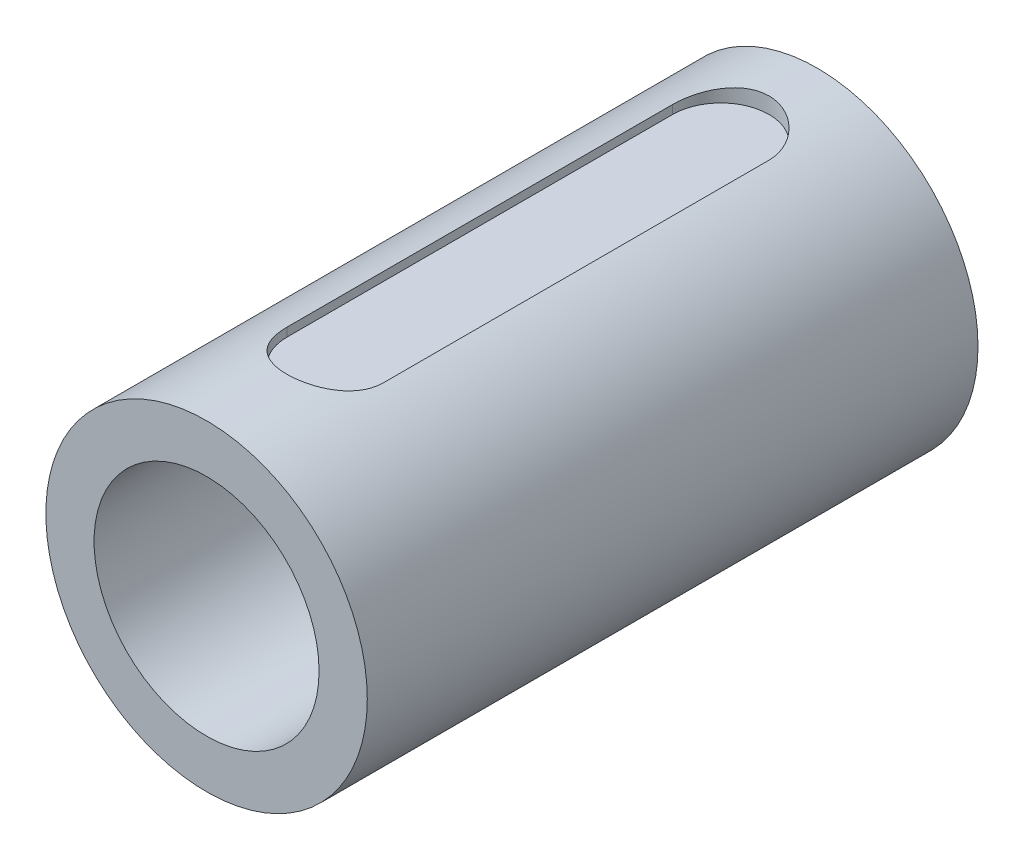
from build123d import *

# Parameters (mm, degrees)
SKETCH_1_R               = 5
SKETCH_1_R_2             = 3.5
EXTRUDE_1_DEPTH          = 19
CUT_EXTRUDE_1_REACH      = 23.823
CUT_EXTRUDE_1_END_RADIUS = 5


with BuildPart() as part:
    # Sketch 1 → Extrude 1 (new body)
    with BuildSketch(Plane.XY):
        Circle(SKETCH_1_R)
        Circle(SKETCH_1_R_2, mode=Mode.SUBTRACT)
    extrude(amount=-EXTRUDE_1_DEPTH)

    # Cut-Extrude 1: up to this cylinder (the profile starts inside it)
    cut_extrude_1_end = Plane(origin=(0, 0, -10), z_dir=(0, 0, 1)) * Cylinder(CUT_EXTRUDE_1_END_RADIUS, 58.646, mode=Mode.PRIVATE)
    # Sketch 2 → Cut-Extrude 1 (cut, up to the surface)
    with BuildSketch(Plane(origin=(0, 4.5, 0), x_dir=(-1, 0, 0), z_dir=(0, 1, 0)), mode=Mode.PRIVATE) as cut_extrude_1_sk1:
        with BuildLine():
            Line((-1.5, -4), (-1.5, -16))
            ThreePointArc((-1.5, -16), (0, -17.5), (1.5, -16))
            Line((1.5, -16), (1.5, -4))
            ThreePointArc((1.5, -4), (0, -2.5), (-1.5, -4))
        make_face()
    cut_extrude_1_tool1 = extrude(cut_extrude_1_sk1.sketch, amount=CUT_EXTRUDE_1_REACH, mode=Mode.PRIVATE) & cut_extrude_1_end
    add(cut_extrude_1_tool1.solids().sort_by_distance((0, 4.5, -10))[0], mode=Mode.SUBTRACT)


solid = part.part
